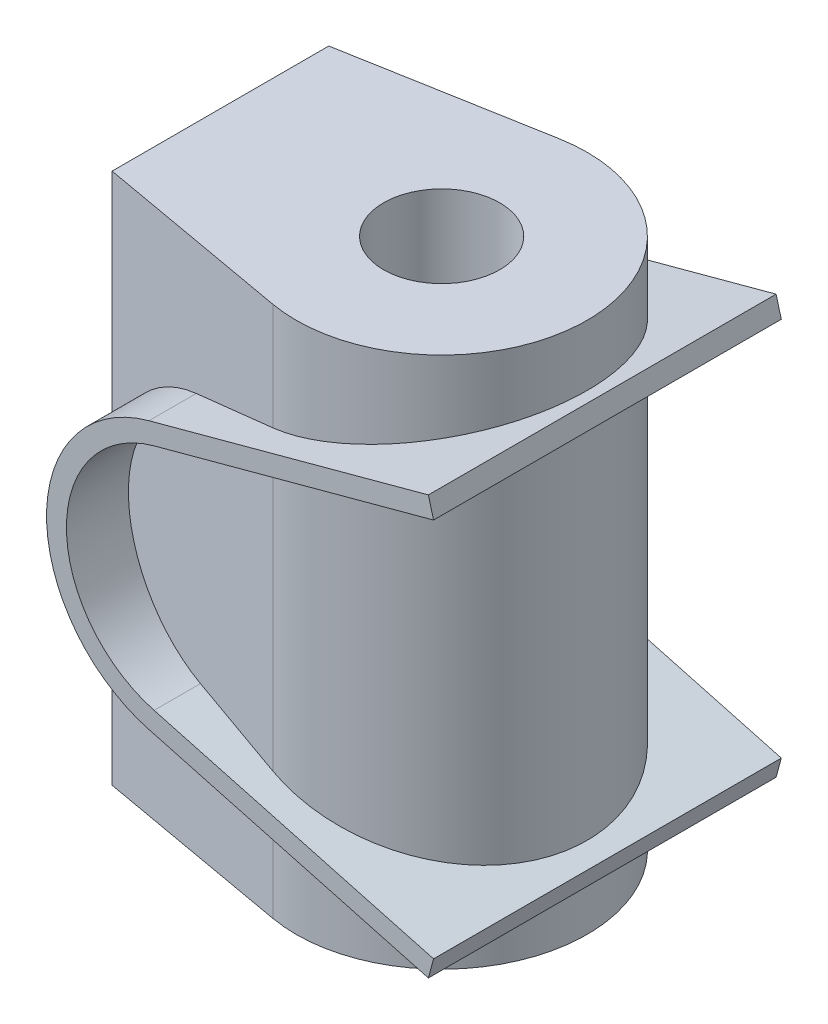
from build123d import *

# Parameters (mm, degrees)
EXTRUDE_THIN1_DEPTH = 22.225
SKETCH2_R           = 7.423053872
EXTRUDE1_DEPTH      = 33.994527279


with BuildPart() as part:
    # Sketch1 → Extrude-Thin1 (new, symmetric)
    with BuildSketch(Plane.XY):
        with BuildLine():
            Line((31.763844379, -24.287282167), (-3.954253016, -14.639562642))
            ThreePointArc((-3.954253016, -14.639562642), (-15.164198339, 0), (-3.954253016, 14.639562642))
            Line((-3.954253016, 14.639562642), (31.763844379, 24.287282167))
            Line((31.763844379, 24.287282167), (31.101507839, 26.7394058))
            Line((31.101507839, 26.7394058), (-4.616589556, 17.091686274))
            ThreePointArc((-4.616589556, 17.091686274), (-17.704198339, 0), (-4.616589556, -17.091686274))
            Line((-4.616589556, -17.091686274), (31.101507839, -26.7394058))
            Line((31.101507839, -26.7394058), (31.763844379, -24.287282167))
        make_face()
    extrude(amount=EXTRUDE_THIN1_DEPTH, both=True)


with BuildPart() as body_2:
    # Sketch2 → Extrude1 (new, symmetric)
    with BuildSketch(Plane(origin=(0, 0, 0), x_dir=(1, 0, 0), z_dir=(0, 1, 0))):
        with BuildLine():
            Line((-17.704198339, 13.847531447), (7.304051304, 18.312759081))
            ThreePointArc((7.304051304, 18.312759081), (29.17617371, 0), (7.304051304, -18.312759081))
            Line((7.304051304, -18.312759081), (-17.704198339, -13.847531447))
            Line((-17.704198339, -13.847531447), (-17.704198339, 13.847531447))
        make_face()
        with Locations(Location((10.573797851, 0, 0), (0, 0, 270))):
            Circle(SKETCH2_R, mode=Mode.SUBTRACT)
    extrude(amount=EXTRUDE1_DEPTH, both=True)


solid = Compound([part.part, body_2.part])
